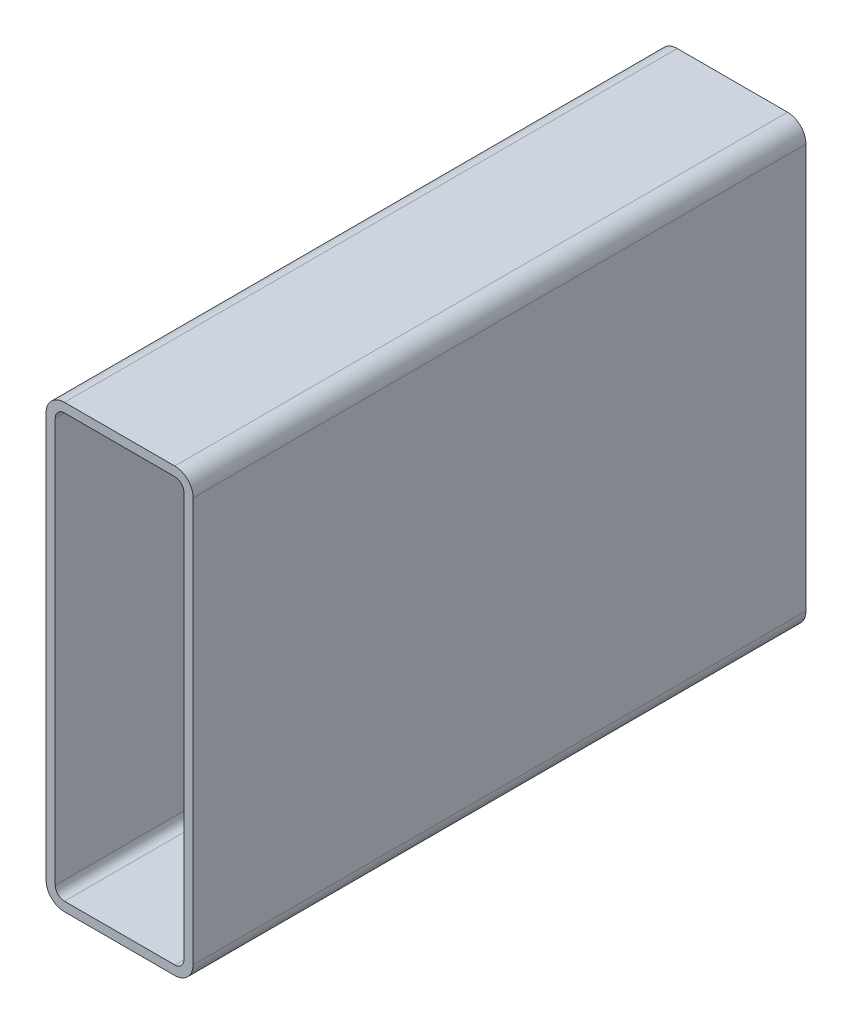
ISO-10303-21;
HEADER;
FILE_DESCRIPTION(('STEP AP214'),'2;1');
FILE_NAME('part.step','',(''),(''),'','','');
FILE_SCHEMA(('AUTOMOTIVE_DESIGN { 1 0 10303 214 1 1 1 1 }'));
ENDSEC;
DATA;
#1=APPLICATION_CONTEXT('core data for automotive mechanical design processes');
#2=APPLICATION_PROTOCOL_DEFINITION('international standard','automotive_design',2000,#1);
#3=PRODUCT_CONTEXT('',#1,'mechanical');
#4=PRODUCT('Part','Part','',(#3));
#5=PRODUCT_RELATED_PRODUCT_CATEGORY('part','',(#4));
#6=PRODUCT_DEFINITION_FORMATION('','',#4);
#7=PRODUCT_DEFINITION_CONTEXT('part definition',#1,'design');
#8=PRODUCT_DEFINITION('design','',#6,#7);
#9=PRODUCT_DEFINITION_SHAPE('','',#8);
#10=(LENGTH_UNIT() NAMED_UNIT(*) SI_UNIT(.MILLI.,.METRE.));
#11=(NAMED_UNIT(*) PLANE_ANGLE_UNIT() SI_UNIT($,.RADIAN.));
#12=(NAMED_UNIT(*) SI_UNIT($,.STERADIAN.) SOLID_ANGLE_UNIT());
#13=UNCERTAINTY_MEASURE_WITH_UNIT(LENGTH_MEASURE(1.E-05),#10,'distance_accuracy_value','');
#14=(GEOMETRIC_REPRESENTATION_CONTEXT(3) GLOBAL_UNCERTAINTY_ASSIGNED_CONTEXT((#13)) GLOBAL_UNIT_ASSIGNED_CONTEXT((#10,
#11,#12)) REPRESENTATION_CONTEXT('',''));
#15=CARTESIAN_POINT('',(0.,0.,0.));
#16=DIRECTION('',(0.,0.,1.));
#17=DIRECTION('',(1.,0.,0.));
#18=AXIS2_PLACEMENT_3D('',#15,#16,#17);
#19=CARTESIAN_POINT('',(12.0141160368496,221.018222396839,317.5));
#20=DIRECTION('',(0.,0.,1.));
#21=DIRECTION('',(1.,0.,0.));
#22=AXIS2_PLACEMENT_3D('',#19,#20,#21);
#23=PLANE('',#22);
#24=CARTESIAN_POINT('',(12.0141160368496,221.018222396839,317.5));
#25=DIRECTION('',(0.,0.,1.));
#26=DIRECTION('',(1.,0.,0.));
#27=AXIS2_PLACEMENT_3D('',#24,#25,#26);
#28=CIRCLE('',#27,9.52500000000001);
#29=CARTESIAN_POINT('',(12.0141160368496,230.543222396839,317.5));
#30=VERTEX_POINT('',#29);
#31=CARTESIAN_POINT('',(2.48911603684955,221.018222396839,317.5));
#32=VERTEX_POINT('',#31);
#33=EDGE_CURVE('E211',#30,#32,#28,.T.);
#34=ORIENTED_EDGE('',*,*,#33,.T.);
#35=DIRECTION('',(0.,-1.,0.));
#36=VECTOR('',#35,1.);
#37=CARTESIAN_POINT('',(2.48911603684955,11.4682223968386,317.5));
#38=LINE('',#37,#36);
#39=CARTESIAN_POINT('',(2.48911603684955,11.4682223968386,317.5));
#40=VERTEX_POINT('',#39);
#41=EDGE_CURVE('E214',#32,#40,#38,.T.);
#42=ORIENTED_EDGE('',*,*,#41,.T.);
#43=CARTESIAN_POINT('',(12.0141160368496,11.4682223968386,317.5));
#44=DIRECTION('',(0.,0.,1.));
#45=DIRECTION('',(1.,0.,0.));
#46=AXIS2_PLACEMENT_3D('',#43,#44,#45);
#47=CIRCLE('',#46,9.525);
#48=CARTESIAN_POINT('',(12.0141160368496,1.94322239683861,317.5));
#49=VERTEX_POINT('',#48);
#50=EDGE_CURVE('E217',#40,#49,#47,.T.);
#51=ORIENTED_EDGE('',*,*,#50,.T.);
#52=DIRECTION('',(1.,0.,0.));
#53=VECTOR('',#52,1.);
#54=CARTESIAN_POINT('',(69.1641160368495,1.94322239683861,317.5));
#55=LINE('',#54,#53);
#56=CARTESIAN_POINT('',(69.1641160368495,1.94322239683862,317.5));
#57=VERTEX_POINT('',#56);
#58=EDGE_CURVE('E219',#49,#57,#55,.T.);
#59=ORIENTED_EDGE('',*,*,#58,.T.);
#60=CARTESIAN_POINT('',(69.1641160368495,11.4682223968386,317.5));
#61=DIRECTION('',(0.,0.,1.));
#62=DIRECTION('',(1.,0.,0.));
#63=AXIS2_PLACEMENT_3D('',#60,#61,#62);
#64=CIRCLE('',#63,9.525);
#65=CARTESIAN_POINT('',(78.6891160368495,11.4682223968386,317.5));
#66=VERTEX_POINT('',#65);
#67=EDGE_CURVE('E221',#57,#66,#64,.T.);
#68=ORIENTED_EDGE('',*,*,#67,.T.);
#69=DIRECTION('',(0.,1.,0.));
#70=VECTOR('',#69,1.);
#71=CARTESIAN_POINT('',(78.6891160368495,221.018222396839,317.5));
#72=LINE('',#71,#70);
#73=CARTESIAN_POINT('',(78.6891160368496,221.018222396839,317.5));
#74=VERTEX_POINT('',#73);
#75=EDGE_CURVE('E223',#66,#74,#72,.T.);
#76=ORIENTED_EDGE('',*,*,#75,.T.);
#77=CARTESIAN_POINT('',(69.1641160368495,221.018222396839,317.5));
#78=DIRECTION('',(0.,0.,1.));
#79=DIRECTION('',(1.,0.,0.));
#80=AXIS2_PLACEMENT_3D('',#77,#78,#79);
#81=CIRCLE('',#80,9.525);
#82=CARTESIAN_POINT('',(69.1641160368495,230.543222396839,317.5));
#83=VERTEX_POINT('',#82);
#84=EDGE_CURVE('E225',#74,#83,#81,.T.);
#85=ORIENTED_EDGE('',*,*,#84,.T.);
#86=DIRECTION('',(-1.,0.,0.));
#87=VECTOR('',#86,1.);
#88=CARTESIAN_POINT('',(12.0141160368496,230.543222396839,317.5));
#89=LINE('',#88,#87);
#90=EDGE_CURVE('E227',#83,#30,#89,.T.);
#91=ORIENTED_EDGE('',*,*,#90,.T.);
#92=EDGE_LOOP('',(#34,#42,#51,#59,#68,#76,#85,#91));
#93=FACE_BOUND('',#92,.T.);
#94=DIRECTION('',(0.,-1.,0.));
#95=VECTOR('',#94,1.);
#96=CARTESIAN_POINT('',(7.25161603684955,11.4682223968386,317.5));
#97=LINE('',#96,#95);
#98=CARTESIAN_POINT('',(7.25161603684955,221.018222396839,317.5));
#99=VERTEX_POINT('',#98);
#100=CARTESIAN_POINT('',(7.25161603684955,11.4682223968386,317.5));
#101=VERTEX_POINT('',#100);
#102=EDGE_CURVE('E154',#99,#101,#97,.T.);
#103=ORIENTED_EDGE('',*,*,#102,.F.);
#104=CARTESIAN_POINT('',(12.0141160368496,221.018222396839,317.5));
#105=DIRECTION('',(0.,0.,1.));
#106=DIRECTION('',(1.,0.,0.));
#107=AXIS2_PLACEMENT_3D('',#104,#105,#106);
#108=CIRCLE('',#107,4.7625);
#109=CARTESIAN_POINT('',(12.0141160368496,225.780722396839,317.5));
#110=VERTEX_POINT('',#109);
#111=EDGE_CURVE('E146',#110,#99,#108,.T.);
#112=ORIENTED_EDGE('',*,*,#111,.F.);
#113=DIRECTION('',(-1.,0.,0.));
#114=VECTOR('',#113,1.);
#115=CARTESIAN_POINT('',(12.0141160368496,225.780722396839,317.5));
#116=LINE('',#115,#114);
#117=CARTESIAN_POINT('',(69.1641160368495,225.780722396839,317.5));
#118=VERTEX_POINT('',#117);
#119=EDGE_CURVE('E179',#118,#110,#116,.T.);
#120=ORIENTED_EDGE('',*,*,#119,.F.);
#121=CARTESIAN_POINT('',(69.1641160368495,221.018222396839,317.5));
#122=DIRECTION('',(0.,0.,1.));
#123=DIRECTION('',(1.,0.,0.));
#124=AXIS2_PLACEMENT_3D('',#121,#122,#123);
#125=CIRCLE('',#124,4.7625);
#126=CARTESIAN_POINT('',(73.9266160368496,221.018222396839,317.5));
#127=VERTEX_POINT('',#126);
#128=EDGE_CURVE('E177',#127,#118,#125,.T.);
#129=ORIENTED_EDGE('',*,*,#128,.F.);
#130=DIRECTION('',(0.,1.,0.));
#131=VECTOR('',#130,1.);
#132=CARTESIAN_POINT('',(73.9266160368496,221.018222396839,317.5));
#133=LINE('',#132,#131);
#134=CARTESIAN_POINT('',(73.9266160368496,11.4682223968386,317.5));
#135=VERTEX_POINT('',#134);
#136=EDGE_CURVE('E175',#135,#127,#133,.T.);
#137=ORIENTED_EDGE('',*,*,#136,.F.);
#138=CARTESIAN_POINT('',(69.1641160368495,11.4682223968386,317.5));
#139=DIRECTION('',(0.,0.,1.));
#140=DIRECTION('',(1.,0.,0.));
#141=AXIS2_PLACEMENT_3D('',#138,#139,#140);
#142=CIRCLE('',#141,4.7625);
#143=CARTESIAN_POINT('',(69.1641160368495,6.70572239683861,317.5));
#144=VERTEX_POINT('',#143);
#145=EDGE_CURVE('E173',#144,#135,#142,.T.);
#146=ORIENTED_EDGE('',*,*,#145,.F.);
#147=DIRECTION('',(1.,0.,0.));
#148=VECTOR('',#147,1.);
#149=CARTESIAN_POINT('',(69.1641160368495,6.70572239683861,317.5));
#150=LINE('',#149,#148);
#151=CARTESIAN_POINT('',(12.0141160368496,6.70572239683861,317.5));
#152=VERTEX_POINT('',#151);
#153=EDGE_CURVE('E169',#152,#144,#150,.T.);
#154=ORIENTED_EDGE('',*,*,#153,.F.);
#155=CARTESIAN_POINT('',(12.0141160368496,11.4682223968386,317.5));
#156=DIRECTION('',(0.,0.,1.));
#157=DIRECTION('',(1.,0.,0.));
#158=AXIS2_PLACEMENT_3D('',#155,#156,#157);
#159=CIRCLE('',#158,4.7625);
#160=EDGE_CURVE('E167',#101,#152,#159,.T.);
#161=ORIENTED_EDGE('',*,*,#160,.F.);
#162=EDGE_LOOP('',(#103,#112,#120,#129,#137,#146,#154,#161));
#163=FACE_BOUND('',#162,.T.);
#164=ADVANCED_FACE('F33',(#93,#163),#23,.T.);
#165=CARTESIAN_POINT('',(12.0141160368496,221.018222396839,0.));
#166=DIRECTION('',(0.,0.,1.));
#167=DIRECTION('',(1.,0.,0.));
#168=AXIS2_PLACEMENT_3D('',#165,#166,#167);
#169=PLANE('',#168);
#170=CARTESIAN_POINT('',(12.0141160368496,221.018222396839,0.));
#171=DIRECTION('',(0.,0.,1.));
#172=DIRECTION('',(1.,0.,0.));
#173=AXIS2_PLACEMENT_3D('',#170,#171,#172);
#174=CIRCLE('',#173,9.52500000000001);
#175=CARTESIAN_POINT('',(12.0141160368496,230.543222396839,0.));
#176=VERTEX_POINT('',#175);
#177=CARTESIAN_POINT('',(2.48911603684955,221.018222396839,0.));
#178=VERTEX_POINT('',#177);
#179=EDGE_CURVE('E162',#176,#178,#174,.T.);
#180=ORIENTED_EDGE('',*,*,#179,.F.);
#181=DIRECTION('',(-1.,0.,0.));
#182=VECTOR('',#181,1.);
#183=CARTESIAN_POINT('',(12.0141160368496,230.543222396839,0.));
#184=LINE('',#183,#182);
#185=CARTESIAN_POINT('',(69.1641160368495,230.543222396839,0.));
#186=VERTEX_POINT('',#185);
#187=EDGE_CURVE('E215',#186,#176,#184,.T.);
#188=ORIENTED_EDGE('',*,*,#187,.F.);
#189=CARTESIAN_POINT('',(69.1641160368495,221.018222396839,0.));
#190=DIRECTION('',(0.,0.,1.));
#191=DIRECTION('',(1.,0.,0.));
#192=AXIS2_PLACEMENT_3D('',#189,#190,#191);
#193=CIRCLE('',#192,9.525);
#194=CARTESIAN_POINT('',(78.6891160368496,221.018222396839,0.));
#195=VERTEX_POINT('',#194);
#196=EDGE_CURVE('E242',#195,#186,#193,.T.);
#197=ORIENTED_EDGE('',*,*,#196,.F.);
#198=DIRECTION('',(0.,1.,0.));
#199=VECTOR('',#198,1.);
#200=CARTESIAN_POINT('',(78.6891160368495,221.018222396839,0.));
#201=LINE('',#200,#199);
#202=CARTESIAN_POINT('',(78.6891160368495,11.4682223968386,0.));
#203=VERTEX_POINT('',#202);
#204=EDGE_CURVE('E240',#203,#195,#201,.T.);
#205=ORIENTED_EDGE('',*,*,#204,.F.);
#206=CARTESIAN_POINT('',(69.1641160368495,11.4682223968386,0.));
#207=DIRECTION('',(0.,0.,1.));
#208=DIRECTION('',(1.,0.,0.));
#209=AXIS2_PLACEMENT_3D('',#206,#207,#208);
#210=CIRCLE('',#209,9.525);
#211=CARTESIAN_POINT('',(69.1641160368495,1.94322239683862,0.));
#212=VERTEX_POINT('',#211);
#213=EDGE_CURVE('E238',#212,#203,#210,.T.);
#214=ORIENTED_EDGE('',*,*,#213,.F.);
#215=DIRECTION('',(1.,0.,0.));
#216=VECTOR('',#215,1.);
#217=CARTESIAN_POINT('',(69.1641160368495,1.94322239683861,0.));
#218=LINE('',#217,#216);
#219=CARTESIAN_POINT('',(12.0141160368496,1.94322239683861,0.));
#220=VERTEX_POINT('',#219);
#221=EDGE_CURVE('E236',#220,#212,#218,.T.);
#222=ORIENTED_EDGE('',*,*,#221,.F.);
#223=CARTESIAN_POINT('',(12.0141160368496,11.4682223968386,0.));
#224=DIRECTION('',(0.,0.,1.));
#225=DIRECTION('',(1.,0.,0.));
#226=AXIS2_PLACEMENT_3D('',#223,#224,#225);
#227=CIRCLE('',#226,9.525);
#228=CARTESIAN_POINT('',(2.48911603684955,11.4682223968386,0.));
#229=VERTEX_POINT('',#228);
#230=EDGE_CURVE('E234',#229,#220,#227,.T.);
#231=ORIENTED_EDGE('',*,*,#230,.F.);
#232=DIRECTION('',(0.,-1.,0.));
#233=VECTOR('',#232,1.);
#234=CARTESIAN_POINT('',(2.48911603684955,11.4682223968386,0.));
#235=LINE('',#234,#233);
#236=EDGE_CURVE('E232',#178,#229,#235,.T.);
#237=ORIENTED_EDGE('',*,*,#236,.F.);
#238=EDGE_LOOP('',(#180,#188,#197,#205,#214,#222,#231,#237));
#239=FACE_BOUND('',#238,.T.);
#240=CARTESIAN_POINT('',(12.0141160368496,221.018222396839,0.));
#241=DIRECTION('',(0.,0.,1.));
#242=DIRECTION('',(1.,0.,0.));
#243=AXIS2_PLACEMENT_3D('',#240,#241,#242);
#244=CIRCLE('',#243,4.7625);
#245=CARTESIAN_POINT('',(12.0141160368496,225.780722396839,0.));
#246=VERTEX_POINT('',#245);
#247=CARTESIAN_POINT('',(7.25161603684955,221.018222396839,0.));
#248=VERTEX_POINT('',#247);
#249=EDGE_CURVE('E56',#246,#248,#244,.T.);
#250=ORIENTED_EDGE('',*,*,#249,.T.);
#251=DIRECTION('',(0.,-1.,0.));
#252=VECTOR('',#251,1.);
#253=CARTESIAN_POINT('',(7.25161603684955,11.4682223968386,0.));
#254=LINE('',#253,#252);
#255=CARTESIAN_POINT('',(7.25161603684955,11.4682223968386,0.));
#256=VERTEX_POINT('',#255);
#257=EDGE_CURVE('E161',#248,#256,#254,.T.);
#258=ORIENTED_EDGE('',*,*,#257,.T.);
#259=CARTESIAN_POINT('',(12.0141160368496,11.4682223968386,0.));
#260=DIRECTION('',(0.,0.,1.));
#261=DIRECTION('',(1.,0.,0.));
#262=AXIS2_PLACEMENT_3D('',#259,#260,#261);
#263=CIRCLE('',#262,4.7625);
#264=CARTESIAN_POINT('',(12.0141160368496,6.70572239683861,0.));
#265=VERTEX_POINT('',#264);
#266=EDGE_CURVE('E183',#256,#265,#263,.T.);
#267=ORIENTED_EDGE('',*,*,#266,.T.);
#268=DIRECTION('',(1.,0.,0.));
#269=VECTOR('',#268,1.);
#270=CARTESIAN_POINT('',(69.1641160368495,6.70572239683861,0.));
#271=LINE('',#270,#269);
#272=CARTESIAN_POINT('',(69.1641160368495,6.70572239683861,0.));
#273=VERTEX_POINT('',#272);
#274=EDGE_CURVE('E186',#265,#273,#271,.T.);
#275=ORIENTED_EDGE('',*,*,#274,.T.);
#276=CARTESIAN_POINT('',(69.1641160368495,11.4682223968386,0.));
#277=DIRECTION('',(0.,0.,1.));
#278=DIRECTION('',(1.,0.,0.));
#279=AXIS2_PLACEMENT_3D('',#276,#277,#278);
#280=CIRCLE('',#279,4.7625);
#281=CARTESIAN_POINT('',(73.9266160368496,11.4682223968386,0.));
#282=VERTEX_POINT('',#281);
#283=EDGE_CURVE('E189',#273,#282,#280,.T.);
#284=ORIENTED_EDGE('',*,*,#283,.T.);
#285=DIRECTION('',(0.,1.,0.));
#286=VECTOR('',#285,1.);
#287=CARTESIAN_POINT('',(73.9266160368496,221.018222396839,0.));
#288=LINE('',#287,#286);
#289=CARTESIAN_POINT('',(73.9266160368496,221.018222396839,0.));
#290=VERTEX_POINT('',#289);
#291=EDGE_CURVE('E192',#282,#290,#288,.T.);
#292=ORIENTED_EDGE('',*,*,#291,.T.);
#293=CARTESIAN_POINT('',(69.1641160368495,221.018222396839,0.));
#294=DIRECTION('',(0.,0.,1.));
#295=DIRECTION('',(1.,0.,0.));
#296=AXIS2_PLACEMENT_3D('',#293,#294,#295);
#297=CIRCLE('',#296,4.7625);
#298=CARTESIAN_POINT('',(69.1641160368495,225.780722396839,0.));
#299=VERTEX_POINT('',#298);
#300=EDGE_CURVE('E195',#290,#299,#297,.T.);
#301=ORIENTED_EDGE('',*,*,#300,.T.);
#302=DIRECTION('',(-1.,0.,0.));
#303=VECTOR('',#302,1.);
#304=CARTESIAN_POINT('',(12.0141160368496,225.780722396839,0.));
#305=LINE('',#304,#303);
#306=EDGE_CURVE('E155',#299,#246,#305,.T.);
#307=ORIENTED_EDGE('',*,*,#306,.T.);
#308=EDGE_LOOP('',(#250,#258,#267,#275,#284,#292,#301,#307));
#309=FACE_BOUND('',#308,.T.);
#310=ADVANCED_FACE('F272',(#239,#309),#169,.F.);
#311=CARTESIAN_POINT('',(12.0141160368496,221.018222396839,317.5));
#312=DIRECTION('',(0.,0.,-1.));
#313=DIRECTION('',(-1.,0.,0.));
#314=AXIS2_PLACEMENT_3D('',#311,#312,#313);
#315=CYLINDRICAL_SURFACE('',#314,9.52500000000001);
#316=ORIENTED_EDGE('',*,*,#179,.T.);
#317=DIRECTION('',(0.,0.,-1.));
#318=VECTOR('',#317,1.);
#319=CARTESIAN_POINT('',(2.48911603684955,221.018222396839,317.5));
#320=LINE('',#319,#318);
#321=EDGE_CURVE('E11',#32,#178,#320,.T.);
#322=ORIENTED_EDGE('',*,*,#321,.F.);
#323=ORIENTED_EDGE('',*,*,#33,.F.);
#324=DIRECTION('',(0.,0.,-1.));
#325=VECTOR('',#324,1.);
#326=CARTESIAN_POINT('',(12.0141160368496,230.543222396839,317.5));
#327=LINE('',#326,#325);
#328=EDGE_CURVE('E229',#30,#176,#327,.T.);
#329=ORIENTED_EDGE('',*,*,#328,.T.);
#330=EDGE_LOOP('',(#316,#322,#323,#329));
#331=FACE_BOUND('',#330,.T.);
#332=ADVANCED_FACE('F35',(#331),#315,.T.);
#333=CARTESIAN_POINT('',(2.48911603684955,11.4682223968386,317.5));
#334=DIRECTION('',(1.,0.,0.));
#335=DIRECTION('',(0.,0.,-1.));
#336=AXIS2_PLACEMENT_3D('',#333,#334,#335);
#337=PLANE('',#336);
#338=ORIENTED_EDGE('',*,*,#236,.T.);
#339=DIRECTION('',(0.,0.,-1.));
#340=VECTOR('',#339,1.);
#341=CARTESIAN_POINT('',(2.48911603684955,11.4682223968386,317.5));
#342=LINE('',#341,#340);
#343=EDGE_CURVE('E41',#40,#229,#342,.T.);
#344=ORIENTED_EDGE('',*,*,#343,.F.);
#345=ORIENTED_EDGE('',*,*,#41,.F.);
#346=ORIENTED_EDGE('',*,*,#321,.T.);
#347=EDGE_LOOP('',(#338,#344,#345,#346));
#348=FACE_BOUND('',#347,.T.);
#349=ADVANCED_FACE('F289',(#348),#337,.F.);
#350=CARTESIAN_POINT('',(12.0141160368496,11.4682223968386,317.5));
#351=DIRECTION('',(0.,0.,-1.));
#352=DIRECTION('',(-1.,0.,0.));
#353=AXIS2_PLACEMENT_3D('',#350,#351,#352);
#354=CYLINDRICAL_SURFACE('',#353,9.525);
#355=ORIENTED_EDGE('',*,*,#230,.T.);
#356=DIRECTION('',(0.,0.,-1.));
#357=VECTOR('',#356,1.);
#358=CARTESIAN_POINT('',(12.0141160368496,1.94322239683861,317.5));
#359=LINE('',#358,#357);
#360=EDGE_CURVE('E259',#49,#220,#359,.T.);
#361=ORIENTED_EDGE('',*,*,#360,.F.);
#362=ORIENTED_EDGE('',*,*,#50,.F.);
#363=ORIENTED_EDGE('',*,*,#343,.T.);
#364=EDGE_LOOP('',(#355,#361,#362,#363));
#365=FACE_BOUND('',#364,.T.);
#366=ADVANCED_FACE('F266',(#365),#354,.T.);
#367=CARTESIAN_POINT('',(69.1641160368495,1.94322239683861,317.5));
#368=DIRECTION('',(0.,1.,0.));
#369=DIRECTION('',(0.,0.,1.));
#370=AXIS2_PLACEMENT_3D('',#367,#368,#369);
#371=PLANE('',#370);
#372=ORIENTED_EDGE('',*,*,#221,.T.);
#373=DIRECTION('',(0.,0.,-1.));
#374=VECTOR('',#373,1.);
#375=CARTESIAN_POINT('',(69.1641160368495,1.94322239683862,317.5));
#376=LINE('',#375,#374);
#377=EDGE_CURVE('E256',#57,#212,#376,.T.);
#378=ORIENTED_EDGE('',*,*,#377,.F.);
#379=ORIENTED_EDGE('',*,*,#58,.F.);
#380=ORIENTED_EDGE('',*,*,#360,.T.);
#381=EDGE_LOOP('',(#372,#378,#379,#380));
#382=FACE_BOUND('',#381,.T.);
#383=ADVANCED_FACE('F278',(#382),#371,.F.);
#384=CARTESIAN_POINT('',(69.1641160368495,11.4682223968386,317.5));
#385=DIRECTION('',(0.,0.,-1.));
#386=DIRECTION('',(-1.,0.,0.));
#387=AXIS2_PLACEMENT_3D('',#384,#385,#386);
#388=CYLINDRICAL_SURFACE('',#387,9.525);
#389=ORIENTED_EDGE('',*,*,#213,.T.);
#390=DIRECTION('',(0.,0.,-1.));
#391=VECTOR('',#390,1.);
#392=CARTESIAN_POINT('',(78.6891160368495,11.4682223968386,317.5));
#393=LINE('',#392,#391);
#394=EDGE_CURVE('E253',#66,#203,#393,.T.);
#395=ORIENTED_EDGE('',*,*,#394,.F.);
#396=ORIENTED_EDGE('',*,*,#67,.F.);
#397=ORIENTED_EDGE('',*,*,#377,.T.);
#398=EDGE_LOOP('',(#389,#395,#396,#397));
#399=FACE_BOUND('',#398,.T.);
#400=ADVANCED_FACE('F282',(#399),#388,.T.);
#401=CARTESIAN_POINT('',(78.6891160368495,221.018222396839,317.5));
#402=DIRECTION('',(-1.,0.,0.));
#403=DIRECTION('',(0.,0.,1.));
#404=AXIS2_PLACEMENT_3D('',#401,#402,#403);
#405=PLANE('',#404);
#406=ORIENTED_EDGE('',*,*,#204,.T.);
#407=DIRECTION('',(0.,0.,-1.));
#408=VECTOR('',#407,1.);
#409=CARTESIAN_POINT('',(78.6891160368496,221.018222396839,317.5));
#410=LINE('',#409,#408);
#411=EDGE_CURVE('E250',#74,#195,#410,.T.);
#412=ORIENTED_EDGE('',*,*,#411,.F.);
#413=ORIENTED_EDGE('',*,*,#75,.F.);
#414=ORIENTED_EDGE('',*,*,#394,.T.);
#415=EDGE_LOOP('',(#406,#412,#413,#414));
#416=FACE_BOUND('',#415,.T.);
#417=ADVANCED_FACE('F302',(#416),#405,.F.);
#418=CARTESIAN_POINT('',(69.1641160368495,221.018222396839,317.5));
#419=DIRECTION('',(0.,0.,-1.));
#420=DIRECTION('',(-1.,0.,0.));
#421=AXIS2_PLACEMENT_3D('',#418,#419,#420);
#422=CYLINDRICAL_SURFACE('',#421,9.525);
#423=ORIENTED_EDGE('',*,*,#196,.T.);
#424=DIRECTION('',(0.,0.,-1.));
#425=VECTOR('',#424,1.);
#426=CARTESIAN_POINT('',(69.1641160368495,230.543222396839,317.5));
#427=LINE('',#426,#425);
#428=EDGE_CURVE('E247',#83,#186,#427,.T.);
#429=ORIENTED_EDGE('',*,*,#428,.F.);
#430=ORIENTED_EDGE('',*,*,#84,.F.);
#431=ORIENTED_EDGE('',*,*,#411,.T.);
#432=EDGE_LOOP('',(#423,#429,#430,#431));
#433=FACE_BOUND('',#432,.T.);
#434=ADVANCED_FACE('F300',(#433),#422,.T.);
#435=CARTESIAN_POINT('',(12.0141160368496,230.543222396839,317.5));
#436=DIRECTION('',(0.,-1.,0.));
#437=DIRECTION('',(0.,0.,-1.));
#438=AXIS2_PLACEMENT_3D('',#435,#436,#437);
#439=PLANE('',#438);
#440=ORIENTED_EDGE('',*,*,#187,.T.);
#441=ORIENTED_EDGE('',*,*,#328,.F.);
#442=ORIENTED_EDGE('',*,*,#90,.F.);
#443=ORIENTED_EDGE('',*,*,#428,.T.);
#444=EDGE_LOOP('',(#440,#441,#442,#443));
#445=FACE_BOUND('',#444,.T.);
#446=ADVANCED_FACE('F295',(#445),#439,.F.);
#447=CARTESIAN_POINT('',(12.0141160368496,221.018222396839,317.5));
#448=DIRECTION('',(0.,0.,-1.));
#449=DIRECTION('',(-1.,0.,0.));
#450=AXIS2_PLACEMENT_3D('',#447,#448,#449);
#451=CYLINDRICAL_SURFACE('',#450,4.7625);
#452=ORIENTED_EDGE('',*,*,#249,.F.);
#453=DIRECTION('',(0.,0.,-1.));
#454=VECTOR('',#453,1.);
#455=CARTESIAN_POINT('',(12.0141160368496,225.780722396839,317.5));
#456=LINE('',#455,#454);
#457=EDGE_CURVE('E150',#110,#246,#456,.T.);
#458=ORIENTED_EDGE('',*,*,#457,.F.);
#459=ORIENTED_EDGE('',*,*,#111,.T.);
#460=DIRECTION('',(0.,0.,-1.));
#461=VECTOR('',#460,1.);
#462=CARTESIAN_POINT('',(7.25161603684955,221.018222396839,317.5));
#463=LINE('',#462,#461);
#464=EDGE_CURVE('E149',#99,#248,#463,.T.);
#465=ORIENTED_EDGE('',*,*,#464,.T.);
#466=EDGE_LOOP('',(#452,#458,#459,#465));
#467=FACE_BOUND('',#466,.T.);
#468=ADVANCED_FACE('F148',(#467),#451,.F.);
#469=CARTESIAN_POINT('',(7.25161603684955,11.4682223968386,317.5));
#470=DIRECTION('',(1.,0.,0.));
#471=DIRECTION('',(0.,0.,-1.));
#472=AXIS2_PLACEMENT_3D('',#469,#470,#471);
#473=PLANE('',#472);
#474=ORIENTED_EDGE('',*,*,#257,.F.);
#475=ORIENTED_EDGE('',*,*,#464,.F.);
#476=ORIENTED_EDGE('',*,*,#102,.T.);
#477=DIRECTION('',(0.,0.,-1.));
#478=VECTOR('',#477,1.);
#479=CARTESIAN_POINT('',(7.25161603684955,11.4682223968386,317.5));
#480=LINE('',#479,#478);
#481=EDGE_CURVE('E163',#101,#256,#480,.T.);
#482=ORIENTED_EDGE('',*,*,#481,.T.);
#483=EDGE_LOOP('',(#474,#475,#476,#482));
#484=FACE_BOUND('',#483,.T.);
#485=ADVANCED_FACE('F158',(#484),#473,.T.);
#486=CARTESIAN_POINT('',(12.0141160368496,11.4682223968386,317.5));
#487=DIRECTION('',(0.,0.,-1.));
#488=DIRECTION('',(-1.,0.,0.));
#489=AXIS2_PLACEMENT_3D('',#486,#487,#488);
#490=CYLINDRICAL_SURFACE('',#489,4.7625);
#491=ORIENTED_EDGE('',*,*,#266,.F.);
#492=ORIENTED_EDGE('',*,*,#481,.F.);
#493=ORIENTED_EDGE('',*,*,#160,.T.);
#494=DIRECTION('',(0.,0.,-1.));
#495=VECTOR('',#494,1.);
#496=CARTESIAN_POINT('',(12.0141160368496,6.70572239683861,317.5));
#497=LINE('',#496,#495);
#498=EDGE_CURVE('E208',#152,#265,#497,.T.);
#499=ORIENTED_EDGE('',*,*,#498,.T.);
#500=EDGE_LOOP('',(#491,#492,#493,#499));
#501=FACE_BOUND('',#500,.T.);
#502=ADVANCED_FACE('F327',(#501),#490,.F.);
#503=CARTESIAN_POINT('',(69.1641160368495,6.70572239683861,317.5));
#504=DIRECTION('',(0.,1.,0.));
#505=DIRECTION('',(0.,0.,1.));
#506=AXIS2_PLACEMENT_3D('',#503,#504,#505);
#507=PLANE('',#506);
#508=ORIENTED_EDGE('',*,*,#274,.F.);
#509=ORIENTED_EDGE('',*,*,#498,.F.);
#510=ORIENTED_EDGE('',*,*,#153,.T.);
#511=DIRECTION('',(0.,0.,-1.));
#512=VECTOR('',#511,1.);
#513=CARTESIAN_POINT('',(69.1641160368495,6.70572239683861,317.5));
#514=LINE('',#513,#512);
#515=EDGE_CURVE('E206',#144,#273,#514,.T.);
#516=ORIENTED_EDGE('',*,*,#515,.T.);
#517=EDGE_LOOP('',(#508,#509,#510,#516));
#518=FACE_BOUND('',#517,.T.);
#519=ADVANCED_FACE('F331',(#518),#507,.T.);
#520=CARTESIAN_POINT('',(69.1641160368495,11.4682223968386,317.5));
#521=DIRECTION('',(0.,0.,-1.));
#522=DIRECTION('',(-1.,0.,0.));
#523=AXIS2_PLACEMENT_3D('',#520,#521,#522);
#524=CYLINDRICAL_SURFACE('',#523,4.7625);
#525=ORIENTED_EDGE('',*,*,#283,.F.);
#526=ORIENTED_EDGE('',*,*,#515,.F.);
#527=ORIENTED_EDGE('',*,*,#145,.T.);
#528=DIRECTION('',(0.,0.,-1.));
#529=VECTOR('',#528,1.);
#530=CARTESIAN_POINT('',(73.9266160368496,11.4682223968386,317.5));
#531=LINE('',#530,#529);
#532=EDGE_CURVE('E204',#135,#282,#531,.T.);
#533=ORIENTED_EDGE('',*,*,#532,.T.);
#534=EDGE_LOOP('',(#525,#526,#527,#533));
#535=FACE_BOUND('',#534,.T.);
#536=ADVANCED_FACE('F337',(#535),#524,.F.);
#537=CARTESIAN_POINT('',(73.9266160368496,221.018222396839,317.5));
#538=DIRECTION('',(-1.,0.,0.));
#539=DIRECTION('',(0.,0.,1.));
#540=AXIS2_PLACEMENT_3D('',#537,#538,#539);
#541=PLANE('',#540);
#542=ORIENTED_EDGE('',*,*,#291,.F.);
#543=ORIENTED_EDGE('',*,*,#532,.F.);
#544=ORIENTED_EDGE('',*,*,#136,.T.);
#545=DIRECTION('',(0.,0.,-1.));
#546=VECTOR('',#545,1.);
#547=CARTESIAN_POINT('',(73.9266160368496,221.018222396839,317.5));
#548=LINE('',#547,#546);
#549=EDGE_CURVE('E202',#127,#290,#548,.T.);
#550=ORIENTED_EDGE('',*,*,#549,.T.);
#551=EDGE_LOOP('',(#542,#543,#544,#550));
#552=FACE_BOUND('',#551,.T.);
#553=ADVANCED_FACE('F341',(#552),#541,.T.);
#554=CARTESIAN_POINT('',(69.1641160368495,221.018222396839,317.5));
#555=DIRECTION('',(0.,0.,-1.));
#556=DIRECTION('',(-1.,0.,0.));
#557=AXIS2_PLACEMENT_3D('',#554,#555,#556);
#558=CYLINDRICAL_SURFACE('',#557,4.7625);
#559=ORIENTED_EDGE('',*,*,#300,.F.);
#560=ORIENTED_EDGE('',*,*,#549,.F.);
#561=ORIENTED_EDGE('',*,*,#128,.T.);
#562=DIRECTION('',(0.,0.,-1.));
#563=VECTOR('',#562,1.);
#564=CARTESIAN_POINT('',(69.1641160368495,225.780722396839,317.5));
#565=LINE('',#564,#563);
#566=EDGE_CURVE('E48',#118,#299,#565,.T.);
#567=ORIENTED_EDGE('',*,*,#566,.T.);
#568=EDGE_LOOP('',(#559,#560,#561,#567));
#569=FACE_BOUND('',#568,.T.);
#570=ADVANCED_FACE('F345',(#569),#558,.F.);
#571=CARTESIAN_POINT('',(12.0141160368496,225.780722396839,317.5));
#572=DIRECTION('',(0.,-1.,0.));
#573=DIRECTION('',(0.,0.,-1.));
#574=AXIS2_PLACEMENT_3D('',#571,#572,#573);
#575=PLANE('',#574);
#576=ORIENTED_EDGE('',*,*,#306,.F.);
#577=ORIENTED_EDGE('',*,*,#566,.F.);
#578=ORIENTED_EDGE('',*,*,#119,.T.);
#579=ORIENTED_EDGE('',*,*,#457,.T.);
#580=EDGE_LOOP('',(#576,#577,#578,#579));
#581=FACE_BOUND('',#580,.T.);
#582=ADVANCED_FACE('F349',(#581),#575,.T.);
#583=CLOSED_SHELL('',(#164,#310,#332,#349,#366,#383,#400,#417,#434,#446,#468,#485,#502,#519,
#536,#553,#570,#582));
#584=MANIFOLD_SOLID_BREP('B2',#583);
#585=ADVANCED_BREP_SHAPE_REPRESENTATION('',(#18,#584),#14);
#586=SHAPE_DEFINITION_REPRESENTATION(#9,#585);
ENDSEC;
END-ISO-10303-21;
